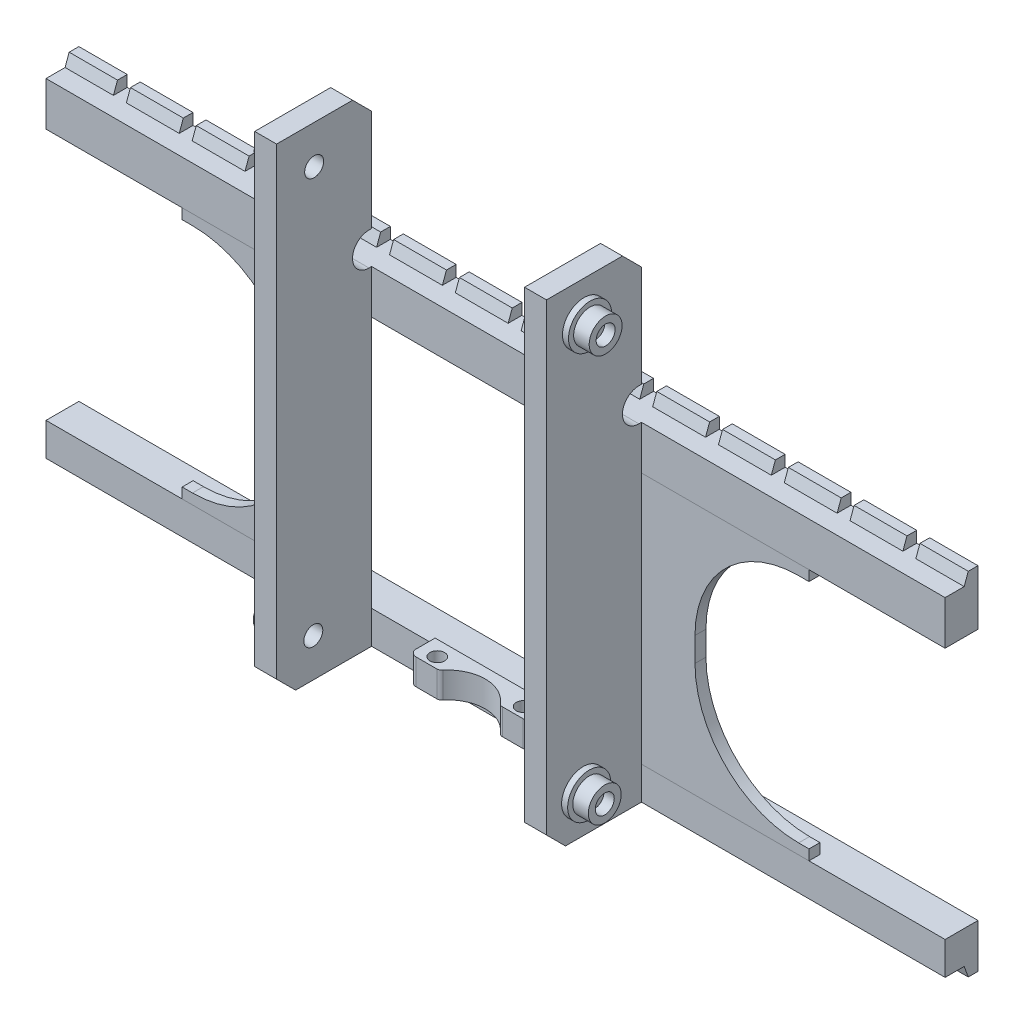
from build123d import *

# Parameters (mm, degrees)
SKETCH2_W                 = 25.4
SKETCH2_H                 = 110
BOSS_EXTRUDE1_DEPTH       = 558.8
BOSS_EXTRUDE1_2_DEPTH     = 558.8
BOSS_EXTRUDE2_DEPTH       = 520.7
BOSS_EXTRUDE3_DEPTH       = 520.7
CUT_EXTRUDE1_DEPTH        = 320
CUT_EXTRUDE1_DEPTH_BACK   = 30
BOSS_EXTRUDE4_DEPTH       = 12.7
SKETCH7_W                 = 15
SKETCH7_H                 = 13
SKETCH7_W_2               = 80
CUT_EXTRUDE2_DEPTH        = 25
BOSS_EXTRUDE5_START       = 25
SKETCH8_R                 = 19.05
BOSS_EXTRUDE5_DEPTH       = 25
BOSS_EXTRUDE5_2_DEPTH     = 25
SKETCH12_R                = 25
BOSS_EXTRUDE9_DEPTH       = 7
SKETCH13_R                = 11
CUT_EXTRUDE3_DEPTH        = 12
SKETCH14_R                = 6
CUT_EXTRUDE4_DEPTH        = 13
CHAMFER1_SIZE             = 22
SKETCH15_R                = 11
CUT_EXTRUDE5_DEPTH        = 338
CHAMFER2_SIZE             = 22
BOSS_EXTRUDE10_DEPTH      = 7
BOSS_EXTRUDE10_DEPTH_BACK = 23
SKETCH23_R                = 8.5
FILLET1_R                 = 8
FILLET2_R                 = 6


with BuildPart() as part:
    # Sketch2 → Boss-Extrude1 (new body)
    with BuildSketch(Plane(origin=(0, 0, 0), x_dir=(1, 0, 0), z_dir=(0, 1, 0))):
        with Locations((156.3, 96)):
            Rectangle(SKETCH2_W, SKETCH2_H)
    extrude(amount=BOSS_EXTRUDE1_DEPTH)



with BuildPart() as body_2:
    # Sketch2 → Boss-Extrude1 2 (new body)
    with BuildSketch(Plane(origin=(0, 0, 0), x_dir=(1, 0, 0), z_dir=(0, 1, 0))):
        with Locations((-156.3, 96)):
            Rectangle(SKETCH2_W, SKETCH2_H)
    extrude(amount=BOSS_EXTRUDE1_2_DEPTH)


with BuildPart() as part_1:
    add(part.part)

    add(body_2.part)  # Boss-Extrude2 merges body 2
    # Sketch3 → Boss-Extrude2 (add, symmetric)
    with BuildSketch(Plane(origin=(0, 0, 0), x_dir=(0, 0, -1), z_dir=(1, 0, 0))):
        Polygon((151, 0), (151, 38.1), (189.1, 38.1), (189.1, -13), (177.831613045, -13), (173.1, 0), align=None)
    extrude(amount=BOSS_EXTRUDE2_DEPTH, both=True)

    # Sketch4 → Boss-Extrude3 (add, symmetric)
    with BuildSketch(Plane(origin=(0, 0, 0), x_dir=(0, 0, -1), z_dir=(1, 0, 0))):
        Polygon((173.1, 381), (151, 381), (151, 330.2), (189.1, 330.2), (189.1, 394), (177.831613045, 394), align=None)
    extrude(amount=BOSS_EXTRUDE3_DEPTH, both=True)

    # Sketch5 → Cut-Extrude1 (cut, two sides: drawn at the far end of the back side and taken through both)
    with BuildSketch(Plane.ZY.offset(-143.6).offset(-CUT_EXTRUDE1_DEPTH_BACK)):
        with BuildLine():
            Line((-151, 381), (-148, 381))
            ThreePointArc((-148, 381), (-128.95, 400.05), (-148, 419.1))
            Line((-148, 419.1), (-151, 419.1))
            Line((-151, 419.1), (-151, 381))
        make_face()
    extrude(amount=CUT_EXTRUDE1_DEPTH + CUT_EXTRUDE1_DEPTH_BACK, mode=Mode.SUBTRACT)

    # Sketch6 → Boss-Extrude4 (add)
    with BuildSketch(Plane(origin=(0, 0, -151), x_dir=(-1, 0, 0), z_dir=(0, 0, -1))):
        with BuildLine():
            Line((163, 330.2), (363, 330.2))
            Line((363, 330.2), (363, 318.2))
            Line((363, 318.2), (351, 318.2))
            ThreePointArc((351, 318.2), (266.147186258, 283.052813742), (231, 198.2))
            Line((231, 198.2), (231, 170.1))
            ThreePointArc((231, 170.1), (266.147186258, 85.247186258), (351, 50.1))
            Line((351, 50.1), (363, 50.1))
            Line((363, 50.1), (363, 38.1))
            Line((363, 38.1), (163, 38.1))
            Line((163, 38.1), (163, 330.2))
        make_face()
        with BuildLine():
            Line((-363, 318.2), (-351, 318.2))
            ThreePointArc((-351, 318.2), (-266.147186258, 283.052813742), (-231, 198.2))
            Line((-231, 198.2), (-231, 170.1))
            ThreePointArc((-231, 170.1), (-266.147186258, 85.247186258), (-351, 50.1))
            Line((-351, 50.1), (-363, 50.1))
            Line((-363, 50.1), (-363, 38.1))
            Line((-363, 38.1), (-163, 38.1))
            Line((-163, 38.1), (-163, 330.2))
            Line((-163, 330.2), (-363, 330.2))
            Line((-363, 330.2), (-363, 318.2))
        make_face()
    extrude(amount=BOSS_EXTRUDE4_DEPTH)

    # Sketch7 → Cut-Extrude2 (cut)
    with BuildSketch(Plane(origin=(0, 0, -189.1), x_dir=(-1, 0, 0), z_dir=(0, 0, -1))):
        with Locations((457.2, 387.5)):
            Rectangle(SKETCH7_W, SKETCH7_H)
        with Locations((381, 387.5)):
            Rectangle(SKETCH7_W, SKETCH7_H)
        with Locations((304.8, 387.5)):
            Rectangle(SKETCH7_W, SKETCH7_H)
        with Locations((228.6, 387.5)):
            Rectangle(SKETCH7_W, SKETCH7_H)
        with Locations((152.4, 387.5)):
            Rectangle(SKETCH7_W, SKETCH7_H)
        with Locations((76.2, 387.5)):
            Rectangle(SKETCH7_W, SKETCH7_H)
        with Locations((0, 387.5)):
            Rectangle(SKETCH7_W, SKETCH7_H)
        with Locations((-76.2, 387.5)):
            Rectangle(SKETCH7_W, SKETCH7_H)
        with Locations((-152.4, 387.5)):
            Rectangle(SKETCH7_W, SKETCH7_H)
        with Locations((-228.6, 387.5)):
            Rectangle(SKETCH7_W, SKETCH7_H)
        with Locations((-304.8, 387.5)):
            Rectangle(SKETCH7_W, SKETCH7_H)
        with Locations((-381, 387.5)):
            Rectangle(SKETCH7_W, SKETCH7_H)
        with Locations((-457.2, 387.5)):
            Rectangle(SKETCH7_W, SKETCH7_H)
        with Locations((50, -6.5)):
            Rectangle(SKETCH7_W_2, SKETCH7_H)
    extrude(amount=-CUT_EXTRUDE2_DEPTH, mode=Mode.SUBTRACT)

    # Chamfer1
    chamfer1_edges = [part_1.edges().sort_by_distance(p)[0] for p in [
        (156.3, 558.8, -151),
        (-156.3, 558.8, -151),
    ]]
    chamfer(chamfer1_edges, length=CHAMFER1_SIZE)

    # Sketch15 → Cut-Extrude5 (cut)
    with BuildSketch(Plane(origin=(169, 0, 0), x_dir=(0, 0, -1), z_dir=(1, 0, 0))):
        with Locations((84.5, 514.35)):
            Circle(SKETCH15_R)
        with Locations((83.5, 44.45)):
            Circle(SKETCH15_R)
    extrude(amount=-CUT_EXTRUDE5_DEPTH, mode=Mode.SUBTRACT)


with BuildPart() as body_2_2:
    # Sketch8 → Boss-Extrude5 (new body)
    with BuildSketch(Plane(origin=(169, 0, 0), x_dir=(0, 0, -1), z_dir=(1, 0, 0)).offset(BOSS_EXTRUDE5_START)):
        with Locations((83.5, 44.45)):
            Circle(SKETCH8_R)
    extrude(amount=-BOSS_EXTRUDE5_DEPTH)



with BuildPart() as body_3:
    # Sketch8 → Boss-Extrude5 2 (new body)
    with BuildSketch(Plane(origin=(169, 0, 0), x_dir=(0, 0, -1), z_dir=(1, 0, 0)).offset(BOSS_EXTRUDE5_START)):
        with Locations((84.5, 514.35)):
            Circle(SKETCH8_R)
    extrude(amount=-BOSS_EXTRUDE5_2_DEPTH)


with BuildPart() as body_2_2_1:
    add(body_2_2.part)

    add(body_3.part)  # Boss-Extrude9 merges body 3
    # Sketch12 → Boss-Extrude9 (add)
    with BuildSketch(Plane.ZY.offset(-169)):
        with Locations((-84.5, 514.35)):
            Circle(SKETCH12_R)
        with Locations((-83.5, 44.45)):
            Circle(SKETCH12_R)
    extrude(amount=-BOSS_EXTRUDE9_DEPTH)

    # Sketch13 → Cut-Extrude3 (cut)
    with BuildSketch(Plane(origin=(194, 0, 0), x_dir=(0, 0, -1), z_dir=(1, 0, 0))):
        with Locations((84.5, 514.35)):
            Circle(SKETCH13_R)
        with Locations((83.5, 44.45)):
            Circle(SKETCH13_R)
    extrude(amount=-CUT_EXTRUDE3_DEPTH, mode=Mode.SUBTRACT)

    # Sketch14 → Cut-Extrude4 (cut)
    with BuildSketch(Plane(origin=(182, 0, 0), x_dir=(0, 0, -1), z_dir=(1, 0, 0))):
        with Locations((84.5, 514.35)):
            Circle(SKETCH14_R)
        with Locations((83.5, 44.45)):
            Circle(SKETCH14_R)
    extrude(amount=-CUT_EXTRUDE4_DEPTH, mode=Mode.SUBTRACT)


with BuildPart() as body_3_2:
    # Mirror1: mirrored copy
    add(body_2_2_1.part.mirror(Plane(origin=(0, 0, 0), x_dir=(0, 0, 1), z_dir=(1, 0, 0))))


with BuildPart() as body_2_2_2:
    add(body_2_2_1.part)

    # Combine1: union body 3 2, part
    add(body_3_2.part)
    add(part_1.part)

    # Chamfer2
    chamfer2_edges = [body_2_2_2.edges().sort_by_distance(p)[0] for p in [
        (156.3, 0, -41),
        (-156.3, 0, -41),
    ]]
    chamfer(chamfer2_edges, length=CHAMFER2_SIZE)

    # Sketch23 → Boss-Extrude10 (add, two sides: drawn at the far end of the back side and taken through both)
    with BuildSketch(Plane(origin=(0, 38.1, 0), x_dir=(1, 0, 0), z_dir=(0, 1, 0)).offset(-BOSS_EXTRUDE10_DEPTH_BACK)):
        with BuildLine():
            Line((-70, 151), (-70, 121))
            Line((-70, 121), (-34.985711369, 121))
            ThreePointArc((-34.985711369, 121), (0, 139), (34.985711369, 121))
            Line((34.985711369, 121), (70, 121))
            Line((70, 121), (70, 151))
            Line((70, 151), (0, 151))
            Line((0, 151), (-70, 151))
        make_face()
        with Locations(Location((-50, 133.5, 0), (0, 0, 270))):
            Circle(SKETCH23_R, mode=Mode.SUBTRACT)
        with Locations(Location((50, 133.5, 0), (0, 0, 90))):
            Circle(SKETCH23_R, mode=Mode.SUBTRACT)
    extrude(amount=BOSS_EXTRUDE10_DEPTH + BOSS_EXTRUDE10_DEPTH_BACK)

    # Fillet1
    fillet1_edges = [body_2_2_2.edges().sort_by_distance(p)[0] for p in [
        (70, 30.1, -121),
        (-70, 30.1, -121),
    ]]
    fillet(fillet1_edges, radius=FILLET1_R)

    # Fillet2
    fillet2_edges = [body_2_2_2.edges().sort_by_distance(p)[0] for p in [
        (34.985711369, 30.1, -121),
        (-34.985711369, 30.1, -121),
    ]]
    fillet(fillet2_edges, radius=FILLET2_R)


solid = body_2_2_2.part
